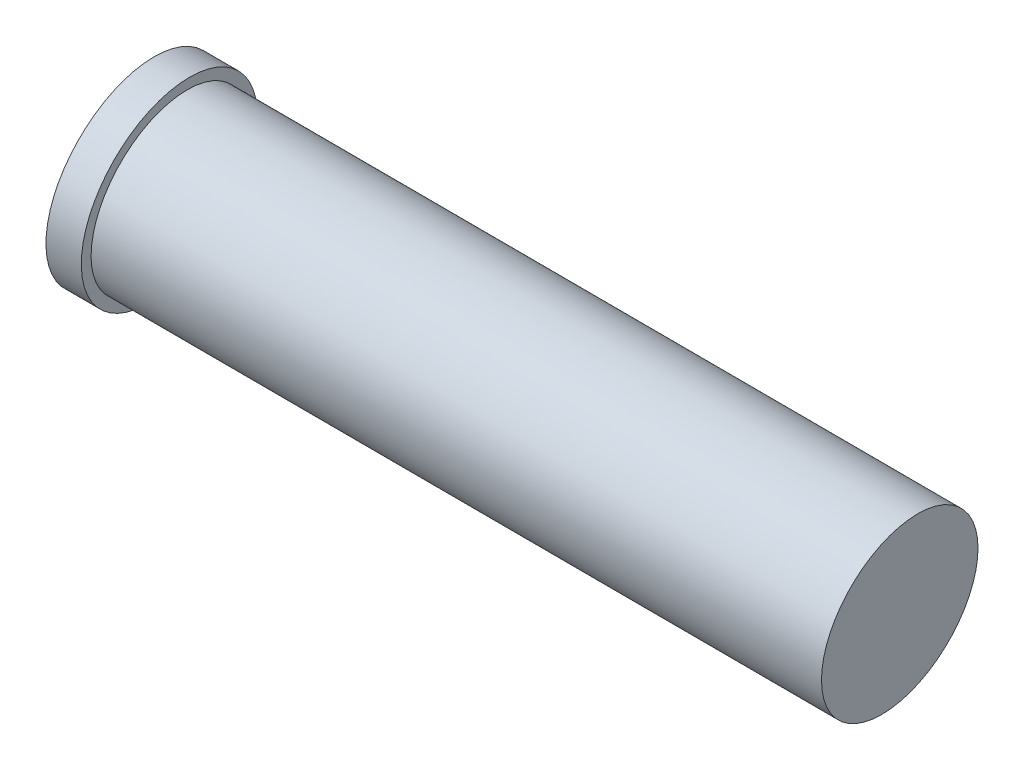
from build123d import *

# Parameters (mm, degrees)
PUNO_PROFILE_R         = 16
COLLARIN_PROFILE_R     = 18
AGUJERO_PUNO_PROFILE_R = 11.1


with BuildPart() as part:
    # Puno: sweep along a curve in space
    with BuildLine() as puno_path:
        Line((250.773980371, 39.928614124, -26.455404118), (379.480094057, 26.797990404, -39.196009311))
    # Puno profile (on start of the path) → Puno (sweep)
    with BuildSketch(Plane(origin=(250.773980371, 39.928614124, -26.455404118), x_dir=(0.10149339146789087, 0.9948362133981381, 0), z_dir=(0.9900470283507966, -0.10100479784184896, -0.09800465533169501))):
        Circle(PUNO_PROFILE_R)
    sweep(path=puno_path.line)

    # Collarin: sweep along a curve in space
    with BuildLine() as collarin_path:
        Line((250.773980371, 39.928614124, -26.455404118), (256.714262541, 39.322585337, -27.04343205))
    # Collarin profile (on start of the path) → Collarin (sweep)
    with BuildSketch(Plane(origin=(250.773980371, 39.928614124, -26.455404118), x_dir=(0.10149339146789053, 0.994836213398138, 0), z_dir=(0.9900470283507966, -0.10100479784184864, -0.09800465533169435))):
        Circle(COLLARIN_PROFILE_R)
    sweep(path=collarin_path.line)

    # Agujero_puno: sweep along a curve in space
    with BuildLine() as agujero_puno_path:
        Line((249.783933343, 40.029618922, -26.357399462), (377.5, 27, -39))
    # Agujero_puno profile (on start of the path) → Agujero_puno (sweep, cut)
    with BuildSketch(Plane(origin=(249.783933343, 40.029618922, -26.357399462), x_dir=(0.10149339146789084, 0.994836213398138, 0), z_dir=(0.9900470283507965, -0.10100479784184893, -0.09800465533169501))):
        Circle(AGUJERO_PUNO_PROFILE_R)
    sweep(path=agujero_puno_path.line, mode=Mode.SUBTRACT)


solid = part.part
